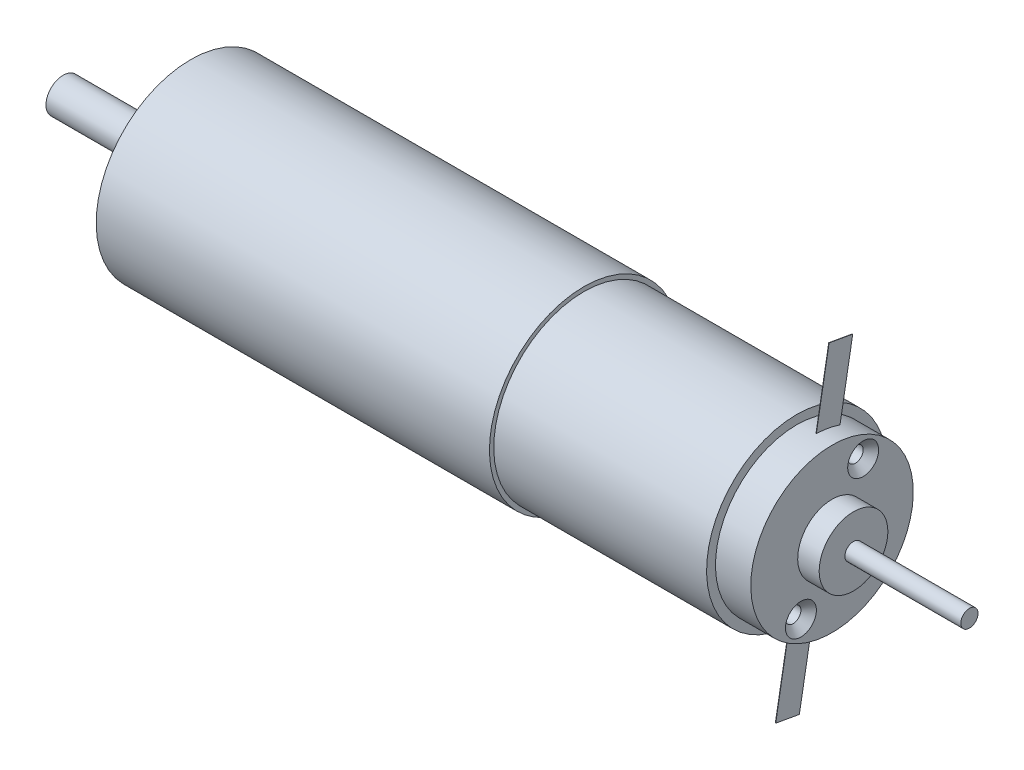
ISO-10303-21;
HEADER;
FILE_DESCRIPTION(('STEP AP214'),'2;1');
FILE_NAME('part.step','',(''),(''),'','','');
FILE_SCHEMA(('AUTOMOTIVE_DESIGN { 1 0 10303 214 1 1 1 1 }'));
ENDSEC;
DATA;
#1=APPLICATION_CONTEXT('core data for automotive mechanical design processes');
#2=APPLICATION_PROTOCOL_DEFINITION('international standard','automotive_design',2000,#1);
#3=PRODUCT_CONTEXT('',#1,'mechanical');
#4=PRODUCT('Part','Part','',(#3));
#5=PRODUCT_RELATED_PRODUCT_CATEGORY('part','',(#4));
#6=PRODUCT_DEFINITION_FORMATION('','',#4);
#7=PRODUCT_DEFINITION_CONTEXT('part definition',#1,'design');
#8=PRODUCT_DEFINITION('design','',#6,#7);
#9=PRODUCT_DEFINITION_SHAPE('','',#8);
#10=(LENGTH_UNIT() NAMED_UNIT(*) SI_UNIT(.MILLI.,.METRE.));
#11=(NAMED_UNIT(*) PLANE_ANGLE_UNIT() SI_UNIT($,.RADIAN.));
#12=(NAMED_UNIT(*) SI_UNIT($,.STERADIAN.) SOLID_ANGLE_UNIT());
#13=UNCERTAINTY_MEASURE_WITH_UNIT(LENGTH_MEASURE(1.E-05),#10,'distance_accuracy_value','');
#14=(GEOMETRIC_REPRESENTATION_CONTEXT(3) GLOBAL_UNCERTAINTY_ASSIGNED_CONTEXT((#13)) GLOBAL_UNIT_ASSIGNED_CONTEXT((#10,
#11,#12)) REPRESENTATION_CONTEXT('',''));
#15=CARTESIAN_POINT('',(0.,0.,0.));
#16=DIRECTION('',(0.,0.,1.));
#17=DIRECTION('',(1.,0.,0.));
#18=AXIS2_PLACEMENT_3D('',#15,#16,#17);
#19=CARTESIAN_POINT('',(44.9,0.,0.));
#20=DIRECTION('',(1.,0.,0.));
#21=DIRECTION('',(0.,1.,0.));
#22=AXIS2_PLACEMENT_3D('',#19,#20,#21);
#23=CYLINDRICAL_SURFACE('',#22,9.46149999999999);
#24=CARTESIAN_POINT('',(26.8252,0.,0.));
#25=DIRECTION('',(-1.,0.,0.));
#26=DIRECTION('',(0.,-1.,0.));
#27=AXIS2_PLACEMENT_3D('',#24,#25,#26);
#28=CIRCLE('',#27,9.46149999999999);
#29=CARTESIAN_POINT('',(26.8252,9.45829739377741,-0.246155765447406));
#30=VERTEX_POINT('',#29);
#31=CARTESIAN_POINT('',(26.8252,8.97208249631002,-3.00361747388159));
#32=VERTEX_POINT('',#31);
#33=EDGE_CURVE('E280',#30,#32,#28,.T.);
#34=ORIENTED_EDGE('',*,*,#33,.F.);
#35=DIRECTION('',(1.,0.,0.));
#36=VECTOR('',#35,1.);
#37=CARTESIAN_POINT('',(44.9,9.45829739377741,-0.246155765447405));
#38=LINE('',#37,#36);
#39=CARTESIAN_POINT('',(26.7852,9.45829739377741,-0.246155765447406));
#40=VERTEX_POINT('',#39);
#41=EDGE_CURVE('E278',#40,#30,#38,.T.);
#42=ORIENTED_EDGE('',*,*,#41,.F.);
#43=CARTESIAN_POINT('',(26.7852,0.,0.));
#44=DIRECTION('',(-1.,0.,0.));
#45=DIRECTION('',(0.,-1.,0.));
#46=AXIS2_PLACEMENT_3D('',#43,#44,#45);
#47=CIRCLE('',#46,9.46149999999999);
#48=CARTESIAN_POINT('',(26.7852,8.97208249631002,-3.00361747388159));
#49=VERTEX_POINT('',#48);
#50=EDGE_CURVE('E273',#40,#49,#47,.T.);
#51=ORIENTED_EDGE('',*,*,#50,.T.);
#52=DIRECTION('',(1.,0.,0.));
#53=VECTOR('',#52,1.);
#54=CARTESIAN_POINT('',(44.9,8.97208249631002,-3.00361747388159));
#55=LINE('',#54,#53);
#56=EDGE_CURVE('E276',#32,#49,#55,.F.);
#57=ORIENTED_EDGE('',*,*,#56,.F.);
#58=EDGE_LOOP('',(#34,#42,#51,#57));
#59=FACE_BOUND('',#58,.T.);
#60=CARTESIAN_POINT('',(28.9,0.,0.));
#61=DIRECTION('',(1.,0.,0.));
#62=DIRECTION('',(0.,1.,0.));
#63=AXIS2_PLACEMENT_3D('',#60,#61,#62);
#64=CIRCLE('',#63,9.46149999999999);
#65=CARTESIAN_POINT('',(28.9,9.46149999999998,0.));
#66=VERTEX_POINT('',#65);
#67=EDGE_CURVE('E228',#66,#66,#64,.T.);
#68=ORIENTED_EDGE('',*,*,#67,.F.);
#69=EDGE_LOOP('',(#68));
#70=FACE_BOUND('',#69,.T.);
#71=CARTESIAN_POINT('',(24.7852,0.,0.));
#72=DIRECTION('',(1.,0.,0.));
#73=DIRECTION('',(0.,1.,0.));
#74=AXIS2_PLACEMENT_3D('',#71,#72,#73);
#75=CIRCLE('',#74,9.46149999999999);
#76=CARTESIAN_POINT('',(24.7852,9.46149999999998,0.));
#77=VERTEX_POINT('',#76);
#78=EDGE_CURVE('E225',#77,#77,#75,.T.);
#79=ORIENTED_EDGE('',*,*,#78,.T.);
#80=EDGE_LOOP('',(#79));
#81=FACE_BOUND('',#80,.T.);
#82=CARTESIAN_POINT('',(26.8252,0.,0.));
#83=DIRECTION('',(-1.,0.,0.));
#84=DIRECTION('',(0.,-1.,0.));
#85=AXIS2_PLACEMENT_3D('',#82,#83,#84);
#86=CIRCLE('',#85,9.46149999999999);
#87=CARTESIAN_POINT('',(26.8252,-9.45829739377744,0.246155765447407));
#88=VERTEX_POINT('',#87);
#89=CARTESIAN_POINT('',(26.8252,-8.97208249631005,3.00361747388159));
#90=VERTEX_POINT('',#89);
#91=EDGE_CURVE('E11',#88,#90,#86,.T.);
#92=ORIENTED_EDGE('',*,*,#91,.F.);
#93=DIRECTION('',(1.,0.,0.));
#94=VECTOR('',#93,1.);
#95=CARTESIAN_POINT('',(44.9,-9.45829739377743,0.246155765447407));
#96=LINE('',#95,#94);
#97=CARTESIAN_POINT('',(26.7852,-9.45829739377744,0.246155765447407));
#98=VERTEX_POINT('',#97);
#99=EDGE_CURVE('E285',#98,#88,#96,.T.);
#100=ORIENTED_EDGE('',*,*,#99,.F.);
#101=CARTESIAN_POINT('',(26.7852,0.,0.));
#102=DIRECTION('',(-1.,0.,0.));
#103=DIRECTION('',(0.,-1.,0.));
#104=AXIS2_PLACEMENT_3D('',#101,#102,#103);
#105=CIRCLE('',#104,9.46149999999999);
#106=CARTESIAN_POINT('',(26.7852,-8.97208249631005,3.00361747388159));
#107=VERTEX_POINT('',#106);
#108=EDGE_CURVE('E282',#98,#107,#105,.T.);
#109=ORIENTED_EDGE('',*,*,#108,.T.);
#110=DIRECTION('',(1.,0.,0.));
#111=VECTOR('',#110,1.);
#112=CARTESIAN_POINT('',(44.9,-8.97208249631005,3.00361747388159));
#113=LINE('',#112,#111);
#114=EDGE_CURVE('E45',#90,#107,#113,.F.);
#115=ORIENTED_EDGE('',*,*,#114,.F.);
#116=EDGE_LOOP('',(#92,#100,#109,#115));
#117=FACE_BOUND('',#116,.T.);
#118=ADVANCED_FACE('F37',(#59,#70,#81,#117),#23,.T.);
#119=CARTESIAN_POINT('',(0.,-10.5,0.));
#120=DIRECTION('',(-1.,0.,0.));
#121=DIRECTION('',(0.,-1.,0.));
#122=AXIS2_PLACEMENT_3D('',#119,#120,#121);
#123=PLANE('',#122);
#124=CARTESIAN_POINT('',(0.,0.,0.));
#125=DIRECTION('',(1.,0.,0.));
#126=DIRECTION('',(0.,1.,0.));
#127=AXIS2_PLACEMENT_3D('',#124,#125,#126);
#128=CIRCLE('',#127,10.5);
#129=CARTESIAN_POINT('',(0.,10.5,0.));
#130=VERTEX_POINT('',#129);
#131=EDGE_CURVE('E219',#130,#130,#128,.T.);
#132=ORIENTED_EDGE('',*,*,#131,.F.);
#133=EDGE_LOOP('',(#132));
#134=FACE_BOUND('',#133,.T.);
#135=CARTESIAN_POINT('',(0.,0.,0.));
#136=DIRECTION('',(1.,0.,0.));
#137=DIRECTION('',(0.,1.,0.));
#138=AXIS2_PLACEMENT_3D('',#135,#136,#137);
#139=CIRCLE('',#138,11.);
#140=CARTESIAN_POINT('',(0.,11.,0.));
#141=VERTEX_POINT('',#140);
#142=EDGE_CURVE('E264',#141,#141,#139,.T.);
#143=ORIENTED_EDGE('',*,*,#142,.T.);
#144=EDGE_LOOP('',(#143));
#145=FACE_BOUND('',#144,.T.);
#146=ADVANCED_FACE('F39',(#134,#145),#123,.F.);
#147=CARTESIAN_POINT('',(44.9,0.,0.));
#148=DIRECTION('',(1.,0.,0.));
#149=DIRECTION('',(0.,1.,0.));
#150=AXIS2_PLACEMENT_3D('',#147,#148,#149);
#151=CYLINDRICAL_SURFACE('',#150,11.);
#152=ORIENTED_EDGE('',*,*,#142,.F.);
#153=EDGE_LOOP('',(#152));
#154=FACE_BOUND('',#153,.T.);
#155=CARTESIAN_POINT('',(-45.8,0.,0.));
#156=DIRECTION('',(1.,0.,0.));
#157=DIRECTION('',(0.,1.,0.));
#158=AXIS2_PLACEMENT_3D('',#155,#156,#157);
#159=CIRCLE('',#158,11.);
#160=CARTESIAN_POINT('',(-45.8,11.,0.));
#161=VERTEX_POINT('',#160);
#162=EDGE_CURVE('E261',#161,#161,#159,.T.);
#163=ORIENTED_EDGE('',*,*,#162,.T.);
#164=EDGE_LOOP('',(#163));
#165=FACE_BOUND('',#164,.T.);
#166=ADVANCED_FACE('F320',(#154,#165),#151,.T.);
#167=CARTESIAN_POINT('',(-45.8,-11.,0.));
#168=DIRECTION('',(1.,0.,0.));
#169=DIRECTION('',(0.,1.,0.));
#170=AXIS2_PLACEMENT_3D('',#167,#168,#169);
#171=PLANE('',#170);
#172=CARTESIAN_POINT('',(-45.8,7.,0.));
#173=DIRECTION('',(-1.,0.,0.));
#174=DIRECTION('',(0.,0.,1.));
#175=AXIS2_PLACEMENT_3D('',#172,#173,#174);
#176=CIRCLE('',#175,1.025);
#177=CARTESIAN_POINT('',(-45.8,7.,1.025));
#178=VERTEX_POINT('',#177);
#179=EDGE_CURVE('E152',#178,#178,#176,.T.);
#180=ORIENTED_EDGE('',*,*,#179,.F.);
#181=EDGE_LOOP('',(#180));
#182=FACE_BOUND('',#181,.T.);
#183=CARTESIAN_POINT('',(-45.8,-3.50000000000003,6.06217782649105));
#184=DIRECTION('',(-1.,0.,0.));
#185=DIRECTION('',(0.,0.,1.));
#186=AXIS2_PLACEMENT_3D('',#183,#184,#185);
#187=CIRCLE('',#186,1.025);
#188=CARTESIAN_POINT('',(-45.8,-3.50000000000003,7.08717782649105));
#189=VERTEX_POINT('',#188);
#190=EDGE_CURVE('E158',#189,#189,#187,.T.);
#191=ORIENTED_EDGE('',*,*,#190,.F.);
#192=EDGE_LOOP('',(#191));
#193=FACE_BOUND('',#192,.T.);
#194=CARTESIAN_POINT('',(-45.8,-3.50000000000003,-6.06217782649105));
#195=DIRECTION('',(-1.,0.,0.));
#196=DIRECTION('',(0.,0.,1.));
#197=AXIS2_PLACEMENT_3D('',#194,#195,#196);
#198=CIRCLE('',#197,1.025);
#199=CARTESIAN_POINT('',(-45.8,-3.50000000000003,-5.03717782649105));
#200=VERTEX_POINT('',#199);
#201=EDGE_CURVE('E164',#200,#200,#198,.T.);
#202=ORIENTED_EDGE('',*,*,#201,.F.);
#203=EDGE_LOOP('',(#202));
#204=FACE_BOUND('',#203,.T.);
#205=ORIENTED_EDGE('',*,*,#162,.F.);
#206=EDGE_LOOP('',(#205));
#207=FACE_BOUND('',#206,.T.);
#208=CARTESIAN_POINT('',(-45.8,0.,0.));
#209=DIRECTION('',(1.,0.,0.));
#210=DIRECTION('',(0.,1.,0.));
#211=AXIS2_PLACEMENT_3D('',#208,#209,#210);
#212=CIRCLE('',#211,5.);
#213=CARTESIAN_POINT('',(-45.8,4.99999999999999,0.));
#214=VERTEX_POINT('',#213);
#215=EDGE_CURVE('E258',#214,#214,#212,.T.);
#216=ORIENTED_EDGE('',*,*,#215,.T.);
#217=EDGE_LOOP('',(#216));
#218=FACE_BOUND('',#217,.T.);
#219=ADVANCED_FACE('F371',(#182,#193,#204,#207,#218),#171,.F.);
#220=CARTESIAN_POINT('',(44.9,0.,0.));
#221=DIRECTION('',(1.,0.,0.));
#222=DIRECTION('',(0.,1.,0.));
#223=AXIS2_PLACEMENT_3D('',#220,#221,#222);
#224=CYLINDRICAL_SURFACE('',#223,5.);
#225=ORIENTED_EDGE('',*,*,#215,.F.);
#226=EDGE_LOOP('',(#225));
#227=FACE_BOUND('',#226,.T.);
#228=CARTESIAN_POINT('',(-47.15,0.,0.));
#229=DIRECTION('',(1.,0.,0.));
#230=DIRECTION('',(0.,1.,0.));
#231=AXIS2_PLACEMENT_3D('',#228,#229,#230);
#232=CIRCLE('',#231,5.);
#233=CARTESIAN_POINT('',(-47.15,4.99999999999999,0.));
#234=VERTEX_POINT('',#233);
#235=EDGE_CURVE('E255',#234,#234,#232,.T.);
#236=ORIENTED_EDGE('',*,*,#235,.T.);
#237=EDGE_LOOP('',(#236));
#238=FACE_BOUND('',#237,.T.);
#239=ADVANCED_FACE('F367',(#227,#238),#224,.T.);
#240=CARTESIAN_POINT('',(-47.15,-5.00000000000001,0.));
#241=DIRECTION('',(1.,0.,0.));
#242=DIRECTION('',(0.,1.,0.));
#243=AXIS2_PLACEMENT_3D('',#240,#241,#242);
#244=PLANE('',#243);
#245=ORIENTED_EDGE('',*,*,#235,.F.);
#246=EDGE_LOOP('',(#245));
#247=FACE_BOUND('',#246,.T.);
#248=CARTESIAN_POINT('',(-47.15,0.,0.));
#249=DIRECTION('',(1.,0.,0.));
#250=DIRECTION('',(0.,1.,0.));
#251=AXIS2_PLACEMENT_3D('',#248,#249,#250);
#252=CIRCLE('',#251,3.4925);
#253=CARTESIAN_POINT('',(-47.15,3.49249999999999,0.));
#254=VERTEX_POINT('',#253);
#255=EDGE_CURVE('E252',#254,#254,#252,.T.);
#256=ORIENTED_EDGE('',*,*,#255,.T.);
#257=EDGE_LOOP('',(#256));
#258=FACE_BOUND('',#257,.T.);
#259=ADVANCED_FACE('F363',(#247,#258),#244,.F.);
#260=CARTESIAN_POINT('',(44.9,0.,0.));
#261=DIRECTION('',(1.,0.,0.));
#262=DIRECTION('',(0.,1.,0.));
#263=AXIS2_PLACEMENT_3D('',#260,#261,#262);
#264=CYLINDRICAL_SURFACE('',#263,3.4925);
#265=ORIENTED_EDGE('',*,*,#255,.F.);
#266=EDGE_LOOP('',(#265));
#267=FACE_BOUND('',#266,.T.);
#268=CARTESIAN_POINT('',(-48.95,0.,0.));
#269=DIRECTION('',(1.,0.,0.));
#270=DIRECTION('',(0.,1.,0.));
#271=AXIS2_PLACEMENT_3D('',#268,#269,#270);
#272=CIRCLE('',#271,3.4925);
#273=CARTESIAN_POINT('',(-48.95,3.49249999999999,0.));
#274=VERTEX_POINT('',#273);
#275=EDGE_CURVE('E249',#274,#274,#272,.T.);
#276=ORIENTED_EDGE('',*,*,#275,.T.);
#277=EDGE_LOOP('',(#276));
#278=FACE_BOUND('',#277,.T.);
#279=ADVANCED_FACE('F359',(#267,#278),#264,.T.);
#280=CARTESIAN_POINT('',(-48.95,-3.49250000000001,0.));
#281=DIRECTION('',(1.,0.,0.));
#282=DIRECTION('',(0.,1.,0.));
#283=AXIS2_PLACEMENT_3D('',#280,#281,#282);
#284=PLANE('',#283);
#285=ORIENTED_EDGE('',*,*,#275,.F.);
#286=EDGE_LOOP('',(#285));
#287=FACE_BOUND('',#286,.T.);
#288=CARTESIAN_POINT('',(-48.95,0.,0.));
#289=DIRECTION('',(1.,0.,0.));
#290=DIRECTION('',(0.,1.,0.));
#291=AXIS2_PLACEMENT_3D('',#288,#289,#290);
#292=CIRCLE('',#291,2.);
#293=CARTESIAN_POINT('',(-48.95,1.99999999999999,0.));
#294=VERTEX_POINT('',#293);
#295=EDGE_CURVE('E246',#294,#294,#292,.T.);
#296=ORIENTED_EDGE('',*,*,#295,.T.);
#297=EDGE_LOOP('',(#296));
#298=FACE_BOUND('',#297,.T.);
#299=ADVANCED_FACE('F355',(#287,#298),#284,.F.);
#300=CARTESIAN_POINT('',(44.9,0.,0.));
#301=DIRECTION('',(1.,0.,0.));
#302=DIRECTION('',(0.,1.,0.));
#303=AXIS2_PLACEMENT_3D('',#300,#301,#302);
#304=CYLINDRICAL_SURFACE('',#303,2.);
#305=ORIENTED_EDGE('',*,*,#295,.F.);
#306=EDGE_LOOP('',(#305));
#307=FACE_BOUND('',#306,.T.);
#308=CARTESIAN_POINT('',(-60.65,0.,0.));
#309=DIRECTION('',(1.,0.,0.));
#310=DIRECTION('',(0.,1.,0.));
#311=AXIS2_PLACEMENT_3D('',#308,#309,#310);
#312=CIRCLE('',#311,2.);
#313=CARTESIAN_POINT('',(-60.65,1.32287565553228,-1.5));
#314=VERTEX_POINT('',#313);
#315=CARTESIAN_POINT('',(-60.65,-1.32287565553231,-1.5));
#316=VERTEX_POINT('',#315);
#317=EDGE_CURVE('E243',#314,#316,#312,.T.);
#318=ORIENTED_EDGE('',*,*,#317,.T.);
#319=DIRECTION('',(1.,0.,0.));
#320=VECTOR('',#319,1.);
#321=CARTESIAN_POINT('',(44.9,-1.32287565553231,-1.5));
#322=LINE('',#321,#320);
#323=CARTESIAN_POINT('',(-51.35,-1.32287565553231,-1.5));
#324=VERTEX_POINT('',#323);
#325=EDGE_CURVE('E216',#316,#324,#322,.T.);
#326=ORIENTED_EDGE('',*,*,#325,.T.);
#327=CARTESIAN_POINT('',(-51.35,0.,0.));
#328=DIRECTION('',(1.,0.,0.));
#329=DIRECTION('',(0.,0.,-1.));
#330=AXIS2_PLACEMENT_3D('',#327,#328,#329);
#331=CIRCLE('',#330,2.);
#332=CARTESIAN_POINT('',(-51.35,1.32287565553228,-1.5));
#333=VERTEX_POINT('',#332);
#334=EDGE_CURVE('E270',#324,#333,#331,.T.);
#335=ORIENTED_EDGE('',*,*,#334,.T.);
#336=DIRECTION('',(1.,0.,0.));
#337=VECTOR('',#336,1.);
#338=CARTESIAN_POINT('',(44.9,1.32287565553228,-1.5));
#339=LINE('',#338,#337);
#340=EDGE_CURVE('E213',#333,#314,#339,.F.);
#341=ORIENTED_EDGE('',*,*,#340,.T.);
#342=EDGE_LOOP('',(#318,#326,#335,#341));
#343=FACE_BOUND('',#342,.T.);
#344=ADVANCED_FACE('F351',(#307,#343),#304,.T.);
#345=CARTESIAN_POINT('',(-60.65,-2.00000000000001,0.));
#346=DIRECTION('',(1.,0.,0.));
#347=DIRECTION('',(0.,1.,0.));
#348=AXIS2_PLACEMENT_3D('',#345,#346,#347);
#349=PLANE('',#348);
#350=ORIENTED_EDGE('',*,*,#317,.F.);
#351=DIRECTION('',(0.,-1.,0.));
#352=VECTOR('',#351,1.);
#353=CARTESIAN_POINT('',(-60.65,-2.00000000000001,-1.5));
#354=LINE('',#353,#352);
#355=EDGE_CURVE('E267',#314,#316,#354,.T.);
#356=ORIENTED_EDGE('',*,*,#355,.T.);
#357=EDGE_LOOP('',(#350,#356));
#358=FACE_BOUND('',#357,.T.);
#359=ADVANCED_FACE('F347',(#358),#349,.F.);
#360=CARTESIAN_POINT('',(44.9,-1.,0.));
#361=DIRECTION('',(-1.,0.,0.));
#362=DIRECTION('',(0.,-1.,0.));
#363=AXIS2_PLACEMENT_3D('',#360,#361,#362);
#364=PLANE('',#363);
#365=CARTESIAN_POINT('',(44.9,0.,0.));
#366=DIRECTION('',(1.,0.,0.));
#367=DIRECTION('',(0.,1.,0.));
#368=AXIS2_PLACEMENT_3D('',#365,#366,#367);
#369=CIRCLE('',#368,0.999999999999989);
#370=CARTESIAN_POINT('',(44.9,0.999999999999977,0.));
#371=VERTEX_POINT('',#370);
#372=EDGE_CURVE('E240',#371,#371,#369,.T.);
#373=ORIENTED_EDGE('',*,*,#372,.T.);
#374=EDGE_LOOP('',(#373));
#375=FACE_BOUND('',#374,.T.);
#376=ADVANCED_FACE('F343',(#375),#364,.F.);
#377=CARTESIAN_POINT('',(44.9,0.,0.));
#378=DIRECTION('',(1.,0.,0.));
#379=DIRECTION('',(0.,1.,0.));
#380=AXIS2_PLACEMENT_3D('',#377,#378,#379);
#381=CYLINDRICAL_SURFACE('',#380,0.99999999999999);
#382=ORIENTED_EDGE('',*,*,#372,.F.);
#383=EDGE_LOOP('',(#382));
#384=FACE_BOUND('',#383,.T.);
#385=CARTESIAN_POINT('',(31.4,0.,0.));
#386=DIRECTION('',(1.,0.,0.));
#387=DIRECTION('',(0.,1.,0.));
#388=AXIS2_PLACEMENT_3D('',#385,#386,#387);
#389=CIRCLE('',#388,0.99999999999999);
#390=CARTESIAN_POINT('',(31.4,0.999999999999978,0.));
#391=VERTEX_POINT('',#390);
#392=EDGE_CURVE('E237',#391,#391,#389,.T.);
#393=ORIENTED_EDGE('',*,*,#392,.T.);
#394=EDGE_LOOP('',(#393));
#395=FACE_BOUND('',#394,.T.);
#396=ADVANCED_FACE('F339',(#384,#395),#381,.T.);
#397=CARTESIAN_POINT('',(31.4,-4.,0.));
#398=DIRECTION('',(-1.,0.,0.));
#399=DIRECTION('',(0.,-1.,0.));
#400=AXIS2_PLACEMENT_3D('',#397,#398,#399);
#401=PLANE('',#400);
#402=ORIENTED_EDGE('',*,*,#392,.F.);
#403=EDGE_LOOP('',(#402));
#404=FACE_BOUND('',#403,.T.);
#405=CARTESIAN_POINT('',(31.4,0.,0.));
#406=DIRECTION('',(1.,0.,0.));
#407=DIRECTION('',(0.,1.,0.));
#408=AXIS2_PLACEMENT_3D('',#405,#406,#407);
#409=CIRCLE('',#408,3.99999999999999);
#410=CARTESIAN_POINT('',(31.4,3.99999999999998,0.));
#411=VERTEX_POINT('',#410);
#412=EDGE_CURVE('E234',#411,#411,#409,.T.);
#413=ORIENTED_EDGE('',*,*,#412,.T.);
#414=EDGE_LOOP('',(#413));
#415=FACE_BOUND('',#414,.T.);
#416=ADVANCED_FACE('F335',(#404,#415),#401,.F.);
#417=CARTESIAN_POINT('',(44.9,0.,0.));
#418=DIRECTION('',(1.,0.,0.));
#419=DIRECTION('',(0.,1.,0.));
#420=AXIS2_PLACEMENT_3D('',#417,#418,#419);
#421=CYLINDRICAL_SURFACE('',#420,3.99999999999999);
#422=ORIENTED_EDGE('',*,*,#412,.F.);
#423=EDGE_LOOP('',(#422));
#424=FACE_BOUND('',#423,.T.);
#425=CARTESIAN_POINT('',(28.9,0.,0.));
#426=DIRECTION('',(1.,0.,0.));
#427=DIRECTION('',(0.,1.,0.));
#428=AXIS2_PLACEMENT_3D('',#425,#426,#427);
#429=CIRCLE('',#428,3.99999999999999);
#430=CARTESIAN_POINT('',(28.9,3.99999999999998,0.));
#431=VERTEX_POINT('',#430);
#432=EDGE_CURVE('E231',#431,#431,#429,.T.);
#433=ORIENTED_EDGE('',*,*,#432,.T.);
#434=EDGE_LOOP('',(#433));
#435=FACE_BOUND('',#434,.T.);
#436=ADVANCED_FACE('F331',(#424,#435),#421,.T.);
#437=CARTESIAN_POINT('',(28.9,-9.4615,0.));
#438=DIRECTION('',(-1.,0.,0.));
#439=DIRECTION('',(0.,-1.,0.));
#440=AXIS2_PLACEMENT_3D('',#437,#438,#439);
#441=PLANE('',#440);
#442=CARTESIAN_POINT('',(28.9,6.27868417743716,-3.62500000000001));
#443=DIRECTION('',(1.,0.,0.));
#444=DIRECTION('',(0.,0.,-1.));
#445=AXIS2_PLACEMENT_3D('',#442,#443,#444);
#446=CIRCLE('',#445,1.8);
#447=CARTESIAN_POINT('',(28.9,6.27868417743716,-5.42500000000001));
#448=VERTEX_POINT('',#447);
#449=EDGE_CURVE('E143',#448,#448,#446,.T.);
#450=ORIENTED_EDGE('',*,*,#449,.F.);
#451=EDGE_LOOP('',(#450));
#452=FACE_BOUND('',#451,.T.);
#453=CARTESIAN_POINT('',(28.9,-6.27868417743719,3.62500000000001));
#454=DIRECTION('',(1.,0.,0.));
#455=DIRECTION('',(0.,0.,-1.));
#456=AXIS2_PLACEMENT_3D('',#453,#454,#455);
#457=CIRCLE('',#456,1.8);
#458=CARTESIAN_POINT('',(28.9,-6.27868417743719,1.82500000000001));
#459=VERTEX_POINT('',#458);
#460=EDGE_CURVE('E136',#459,#459,#457,.T.);
#461=ORIENTED_EDGE('',*,*,#460,.F.);
#462=EDGE_LOOP('',(#461));
#463=FACE_BOUND('',#462,.T.);
#464=ORIENTED_EDGE('',*,*,#432,.F.);
#465=EDGE_LOOP('',(#464));
#466=FACE_BOUND('',#465,.T.);
#467=ORIENTED_EDGE('',*,*,#67,.T.);
#468=EDGE_LOOP('',(#467));
#469=FACE_BOUND('',#468,.T.);
#470=ADVANCED_FACE('F328',(#452,#463,#466,#469),#441,.F.);
#471=CARTESIAN_POINT('',(24.7852,-10.5,0.));
#472=DIRECTION('',(-1.,0.,0.));
#473=DIRECTION('',(0.,-1.,0.));
#474=AXIS2_PLACEMENT_3D('',#471,#472,#473);
#475=PLANE('',#474);
#476=ORIENTED_EDGE('',*,*,#78,.F.);
#477=EDGE_LOOP('',(#476));
#478=FACE_BOUND('',#477,.T.);
#479=CARTESIAN_POINT('',(24.7852,0.,0.));
#480=DIRECTION('',(1.,0.,0.));
#481=DIRECTION('',(0.,1.,0.));
#482=AXIS2_PLACEMENT_3D('',#479,#480,#481);
#483=CIRCLE('',#482,10.5);
#484=CARTESIAN_POINT('',(24.7852,10.5,0.));
#485=VERTEX_POINT('',#484);
#486=EDGE_CURVE('E222',#485,#485,#483,.T.);
#487=ORIENTED_EDGE('',*,*,#486,.T.);
#488=EDGE_LOOP('',(#487));
#489=FACE_BOUND('',#488,.T.);
#490=ADVANCED_FACE('F326',(#478,#489),#475,.F.);
#491=CARTESIAN_POINT('',(44.9,0.,0.));
#492=DIRECTION('',(1.,0.,0.));
#493=DIRECTION('',(0.,1.,0.));
#494=AXIS2_PLACEMENT_3D('',#491,#492,#493);
#495=CYLINDRICAL_SURFACE('',#494,10.5);
#496=ORIENTED_EDGE('',*,*,#486,.F.);
#497=EDGE_LOOP('',(#496));
#498=FACE_BOUND('',#497,.T.);
#499=ORIENTED_EDGE('',*,*,#131,.T.);
#500=EDGE_LOOP('',(#499));
#501=FACE_BOUND('',#500,.T.);
#502=ADVANCED_FACE('F401',(#498,#501),#495,.T.);
#503=CARTESIAN_POINT('',(-51.35,-11.,-5.18121484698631));
#504=DIRECTION('',(1.,0.,0.));
#505=DIRECTION('',(0.,0.,-1.));
#506=AXIS2_PLACEMENT_3D('',#503,#504,#505);
#507=PLANE('',#506);
#508=DIRECTION('',(0.,1.,0.));
#509=VECTOR('',#508,1.);
#510=CARTESIAN_POINT('',(-51.35,-11.,-1.5));
#511=LINE('',#510,#509);
#512=EDGE_CURVE('E210',#324,#333,#511,.T.);
#513=ORIENTED_EDGE('',*,*,#512,.T.);
#514=ORIENTED_EDGE('',*,*,#334,.F.);
#515=EDGE_LOOP('',(#513,#514));
#516=FACE_BOUND('',#515,.T.);
#517=ADVANCED_FACE('F399',(#516),#507,.F.);
#518=CARTESIAN_POINT('',(-63.9871380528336,-11.,-1.5));
#519=DIRECTION('',(0.,0.,1.));
#520=DIRECTION('',(1.,0.,0.));
#521=AXIS2_PLACEMENT_3D('',#518,#519,#520);
#522=PLANE('',#521);
#523=ORIENTED_EDGE('',*,*,#355,.F.);
#524=ORIENTED_EDGE('',*,*,#340,.F.);
#525=ORIENTED_EDGE('',*,*,#512,.F.);
#526=ORIENTED_EDGE('',*,*,#325,.F.);
#527=EDGE_LOOP('',(#523,#524,#525,#526));
#528=FACE_BOUND('',#527,.T.);
#529=ADVANCED_FACE('F396',(#528),#522,.F.);
#530=CARTESIAN_POINT('',(26.8252,17.8711662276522,-1.72957152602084));
#531=DIRECTION('',(0.,-0.173648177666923,-0.984807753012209));
#532=DIRECTION('',(0.,0.984807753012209,-0.173648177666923));
#533=AXIS2_PLACEMENT_3D('',#530,#531,#532);
#534=PLANE('',#533);
#535=DIRECTION('',(0.,-0.984807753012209,0.173648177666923));
#536=VECTOR('',#535,1.);
#537=CARTESIAN_POINT('',(26.7852,17.8711662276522,-1.72957152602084));
#538=LINE('',#537,#536);
#539=CARTESIAN_POINT('',(26.7852,17.8711662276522,-1.72957152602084));
#540=VERTEX_POINT('',#539);
#541=EDGE_CURVE('E201',#540,#40,#538,.T.);
#542=ORIENTED_EDGE('',*,*,#541,.T.);
#543=ORIENTED_EDGE('',*,*,#41,.T.);
#544=DIRECTION('',(0.,-0.984807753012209,0.173648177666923));
#545=VECTOR('',#544,1.);
#546=CARTESIAN_POINT('',(26.8252,17.8711662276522,-1.72957152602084));
#547=LINE('',#546,#545);
#548=CARTESIAN_POINT('',(26.8252,17.8711662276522,-1.72957152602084));
#549=VERTEX_POINT('',#548);
#550=EDGE_CURVE('E193',#549,#30,#547,.T.);
#551=ORIENTED_EDGE('',*,*,#550,.F.);
#552=DIRECTION('',(-1.,0.,0.));
#553=VECTOR('',#552,1.);
#554=CARTESIAN_POINT('',(26.8252,17.8711662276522,-1.72957152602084));
#555=LINE('',#554,#553);
#556=EDGE_CURVE('E207',#549,#540,#555,.T.);
#557=ORIENTED_EDGE('',*,*,#556,.T.);
#558=EDGE_LOOP('',(#542,#543,#551,#557));
#559=FACE_BOUND('',#558,.T.);
#560=ADVANCED_FACE('F407',(#559),#534,.F.);
#561=CARTESIAN_POINT('',(26.8252,17.3849513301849,-4.48703323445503));
#562=DIRECTION('',(0.,0.173648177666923,0.984807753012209));
#563=DIRECTION('',(0.,-0.984807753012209,0.173648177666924));
#564=AXIS2_PLACEMENT_3D('',#561,#562,#563);
#565=PLANE('',#564);
#566=DIRECTION('',(0.,0.984807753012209,-0.173648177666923));
#567=VECTOR('',#566,1.);
#568=CARTESIAN_POINT('',(26.8252,17.3849513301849,-4.48703323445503));
#569=LINE('',#568,#567);
#570=CARTESIAN_POINT('',(26.8252,17.3849513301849,-4.48703323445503));
#571=VERTEX_POINT('',#570);
#572=EDGE_CURVE('E196',#32,#571,#569,.T.);
#573=ORIENTED_EDGE('',*,*,#572,.F.);
#574=ORIENTED_EDGE('',*,*,#56,.T.);
#575=DIRECTION('',(0.,0.984807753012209,-0.173648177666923));
#576=VECTOR('',#575,1.);
#577=CARTESIAN_POINT('',(26.7852,17.3849513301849,-4.48703323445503));
#578=LINE('',#577,#576);
#579=CARTESIAN_POINT('',(26.7852,17.3849513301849,-4.48703323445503));
#580=VERTEX_POINT('',#579);
#581=EDGE_CURVE('E60',#49,#580,#578,.T.);
#582=ORIENTED_EDGE('',*,*,#581,.T.);
#583=DIRECTION('',(-1.,0.,0.));
#584=VECTOR('',#583,1.);
#585=CARTESIAN_POINT('',(26.8252,17.3849513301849,-4.48703323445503));
#586=LINE('',#585,#584);
#587=EDGE_CURVE('E198',#571,#580,#586,.T.);
#588=ORIENTED_EDGE('',*,*,#587,.F.);
#589=EDGE_LOOP('',(#573,#574,#582,#588));
#590=FACE_BOUND('',#589,.T.);
#591=ADVANCED_FACE('F418',(#590),#565,.F.);
#592=CARTESIAN_POINT('',(26.8252,17.3849513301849,-4.48703323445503));
#593=DIRECTION('',(-1.,0.,0.));
#594=DIRECTION('',(0.,-1.,0.));
#595=AXIS2_PLACEMENT_3D('',#592,#593,#594);
#596=PLANE('',#595);
#597=ORIENTED_EDGE('',*,*,#550,.T.);
#598=ORIENTED_EDGE('',*,*,#33,.T.);
#599=ORIENTED_EDGE('',*,*,#572,.T.);
#600=DIRECTION('',(0.,0.173648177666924,0.984807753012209));
#601=VECTOR('',#600,1.);
#602=CARTESIAN_POINT('',(26.8252,17.8711662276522,-1.72957152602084));
#603=LINE('',#602,#601);
#604=EDGE_CURVE('E190',#571,#549,#603,.T.);
#605=ORIENTED_EDGE('',*,*,#604,.T.);
#606=EDGE_LOOP('',(#597,#598,#599,#605));
#607=FACE_BOUND('',#606,.T.);
#608=ADVANCED_FACE('F422',(#607),#596,.F.);
#609=CARTESIAN_POINT('',(26.7852,17.3849513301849,-4.48703323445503));
#610=DIRECTION('',(-1.,0.,0.));
#611=DIRECTION('',(0.,-1.,0.));
#612=AXIS2_PLACEMENT_3D('',#609,#610,#611);
#613=PLANE('',#612);
#614=ORIENTED_EDGE('',*,*,#50,.F.);
#615=ORIENTED_EDGE('',*,*,#541,.F.);
#616=DIRECTION('',(0.,0.173648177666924,0.984807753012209));
#617=VECTOR('',#616,1.);
#618=CARTESIAN_POINT('',(26.7852,17.8711662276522,-1.72957152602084));
#619=LINE('',#618,#617);
#620=EDGE_CURVE('E189',#580,#540,#619,.T.);
#621=ORIENTED_EDGE('',*,*,#620,.F.);
#622=ORIENTED_EDGE('',*,*,#581,.F.);
#623=EDGE_LOOP('',(#614,#615,#621,#622));
#624=FACE_BOUND('',#623,.T.);
#625=ADVANCED_FACE('F414',(#624),#613,.T.);
#626=CARTESIAN_POINT('',(26.8252,17.8711662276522,-1.72957152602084));
#627=DIRECTION('',(0.,-0.984807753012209,0.173648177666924));
#628=DIRECTION('',(0.,-0.173648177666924,-0.984807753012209));
#629=AXIS2_PLACEMENT_3D('',#626,#627,#628);
#630=PLANE('',#629);
#631=ORIENTED_EDGE('',*,*,#620,.T.);
#632=ORIENTED_EDGE('',*,*,#556,.F.);
#633=ORIENTED_EDGE('',*,*,#604,.F.);
#634=ORIENTED_EDGE('',*,*,#587,.T.);
#635=EDGE_LOOP('',(#631,#632,#633,#634));
#636=FACE_BOUND('',#635,.T.);
#637=ADVANCED_FACE('F411',(#636),#630,.F.);
#638=CARTESIAN_POINT('',(26.8252,-17.3849513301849,4.48703323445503));
#639=DIRECTION('',(0.,-0.173648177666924,-0.984807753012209));
#640=DIRECTION('',(0.,0.984807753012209,-0.173648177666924));
#641=AXIS2_PLACEMENT_3D('',#638,#639,#640);
#642=PLANE('',#641);
#643=DIRECTION('',(0.,-0.984807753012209,0.173648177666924));
#644=VECTOR('',#643,1.);
#645=CARTESIAN_POINT('',(26.8252,-17.3849513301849,4.48703323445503));
#646=LINE('',#645,#644);
#647=CARTESIAN_POINT('',(26.8252,-17.3849513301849,4.48703323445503));
#648=VERTEX_POINT('',#647);
#649=EDGE_CURVE('E170',#90,#648,#646,.T.);
#650=ORIENTED_EDGE('',*,*,#649,.F.);
#651=ORIENTED_EDGE('',*,*,#114,.T.);
#652=DIRECTION('',(0.,-0.984807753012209,0.173648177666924));
#653=VECTOR('',#652,1.);
#654=CARTESIAN_POINT('',(26.7852,-17.3849513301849,4.48703323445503));
#655=LINE('',#654,#653);
#656=CARTESIAN_POINT('',(26.7852,-17.3849513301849,4.48703323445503));
#657=VERTEX_POINT('',#656);
#658=EDGE_CURVE('E52',#107,#657,#655,.T.);
#659=ORIENTED_EDGE('',*,*,#658,.T.);
#660=DIRECTION('',(-1.,0.,0.));
#661=VECTOR('',#660,1.);
#662=CARTESIAN_POINT('',(26.8252,-17.3849513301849,4.48703323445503));
#663=LINE('',#662,#661);
#664=EDGE_CURVE('E186',#648,#657,#663,.T.);
#665=ORIENTED_EDGE('',*,*,#664,.F.);
#666=EDGE_LOOP('',(#650,#651,#659,#665));
#667=FACE_BOUND('',#666,.T.);
#668=ADVANCED_FACE('F289',(#667),#642,.F.);
#669=CARTESIAN_POINT('',(26.8252,-17.8711662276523,1.72957152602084));
#670=DIRECTION('',(0.,0.173648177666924,0.984807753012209));
#671=DIRECTION('',(0.,-0.984807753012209,0.173648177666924));
#672=AXIS2_PLACEMENT_3D('',#669,#670,#671);
#673=PLANE('',#672);
#674=DIRECTION('',(0.,0.984807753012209,-0.173648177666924));
#675=VECTOR('',#674,1.);
#676=CARTESIAN_POINT('',(26.7852,-17.8711662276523,1.72957152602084));
#677=LINE('',#676,#675);
#678=CARTESIAN_POINT('',(26.7852,-17.8711662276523,1.72957152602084));
#679=VERTEX_POINT('',#678);
#680=EDGE_CURVE('E173',#679,#98,#677,.T.);
#681=ORIENTED_EDGE('',*,*,#680,.T.);
#682=ORIENTED_EDGE('',*,*,#99,.T.);
#683=DIRECTION('',(0.,0.984807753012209,-0.173648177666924));
#684=VECTOR('',#683,1.);
#685=CARTESIAN_POINT('',(26.8252,-17.8711662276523,1.72957152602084));
#686=LINE('',#685,#684);
#687=CARTESIAN_POINT('',(26.8252,-17.8711662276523,1.72957152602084));
#688=VERTEX_POINT('',#687);
#689=EDGE_CURVE('E175',#688,#88,#686,.T.);
#690=ORIENTED_EDGE('',*,*,#689,.F.);
#691=DIRECTION('',(-1.,0.,0.));
#692=VECTOR('',#691,1.);
#693=CARTESIAN_POINT('',(26.8252,-17.8711662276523,1.72957152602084));
#694=LINE('',#693,#692);
#695=EDGE_CURVE('E178',#688,#679,#694,.T.);
#696=ORIENTED_EDGE('',*,*,#695,.T.);
#697=EDGE_LOOP('',(#681,#682,#690,#696));
#698=FACE_BOUND('',#697,.T.);
#699=ADVANCED_FACE('F297',(#698),#673,.F.);
#700=CARTESIAN_POINT('',(26.8252,-5.01029747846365,2.30504788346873));
#701=DIRECTION('',(-1.,0.,0.));
#702=DIRECTION('',(0.,-1.,0.));
#703=AXIS2_PLACEMENT_3D('',#700,#701,#702);
#704=PLANE('',#703);
#705=ORIENTED_EDGE('',*,*,#689,.T.);
#706=ORIENTED_EDGE('',*,*,#91,.T.);
#707=ORIENTED_EDGE('',*,*,#649,.T.);
#708=DIRECTION('',(0.,-0.173648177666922,-0.98480775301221));
#709=VECTOR('',#708,1.);
#710=CARTESIAN_POINT('',(26.8252,-17.3849513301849,4.48703323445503));
#711=LINE('',#710,#709);
#712=EDGE_CURVE('E172',#648,#688,#711,.T.);
#713=ORIENTED_EDGE('',*,*,#712,.T.);
#714=EDGE_LOOP('',(#705,#706,#707,#713));
#715=FACE_BOUND('',#714,.T.);
#716=ADVANCED_FACE('F304',(#715),#704,.F.);
#717=CARTESIAN_POINT('',(26.7852,-5.01029747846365,2.30504788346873));
#718=DIRECTION('',(-1.,0.,0.));
#719=DIRECTION('',(0.,-1.,0.));
#720=AXIS2_PLACEMENT_3D('',#717,#718,#719);
#721=PLANE('',#720);
#722=ORIENTED_EDGE('',*,*,#108,.F.);
#723=ORIENTED_EDGE('',*,*,#680,.F.);
#724=DIRECTION('',(0.,-0.173648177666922,-0.98480775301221));
#725=VECTOR('',#724,1.);
#726=CARTESIAN_POINT('',(26.7852,-17.3849513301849,4.48703323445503));
#727=LINE('',#726,#725);
#728=EDGE_CURVE('E180',#657,#679,#727,.T.);
#729=ORIENTED_EDGE('',*,*,#728,.F.);
#730=ORIENTED_EDGE('',*,*,#658,.F.);
#731=EDGE_LOOP('',(#722,#723,#729,#730));
#732=FACE_BOUND('',#731,.T.);
#733=ADVANCED_FACE('F295',(#732),#721,.T.);
#734=CARTESIAN_POINT('',(26.8252,-17.3849513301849,4.48703323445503));
#735=DIRECTION('',(0.,0.98480775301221,-0.173648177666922));
#736=DIRECTION('',(0.,0.173648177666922,0.98480775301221));
#737=AXIS2_PLACEMENT_3D('',#734,#735,#736);
#738=PLANE('',#737);
#739=ORIENTED_EDGE('',*,*,#728,.T.);
#740=ORIENTED_EDGE('',*,*,#695,.F.);
#741=ORIENTED_EDGE('',*,*,#712,.F.);
#742=ORIENTED_EDGE('',*,*,#664,.T.);
#743=EDGE_LOOP('',(#739,#740,#741,#742));
#744=FACE_BOUND('',#743,.T.);
#745=ADVANCED_FACE('F302',(#744),#738,.F.);
#746=CARTESIAN_POINT('',(-40.45,-3.50000000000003,-6.06217782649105));
#747=DIRECTION('',(-1.,0.,0.));
#748=DIRECTION('',(0.,0.,1.));
#749=AXIS2_PLACEMENT_3D('',#746,#747,#748);
#750=CONICAL_SURFACE('',#749,1.025,1.02974425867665);
#751=CARTESIAN_POINT('',(-39.8341178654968,-3.50000000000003,-6.06217782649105));
#752=VERTEX_POINT('',#751);
#753=VERTEX_LOOP('',#752);
#754=FACE_BOUND('',#753,.T.);
#755=CARTESIAN_POINT('',(-40.45,-3.50000000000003,-6.06217782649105));
#756=DIRECTION('',(-1.,0.,0.));
#757=DIRECTION('',(0.,0.,1.));
#758=AXIS2_PLACEMENT_3D('',#755,#756,#757);
#759=CIRCLE('',#758,1.025);
#760=CARTESIAN_POINT('',(-40.45,-3.50000000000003,-5.03717782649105));
#761=VERTEX_POINT('',#760);
#762=EDGE_CURVE('E167',#761,#761,#759,.T.);
#763=ORIENTED_EDGE('',*,*,#762,.T.);
#764=EDGE_LOOP('',(#763));
#765=FACE_BOUND('',#764,.T.);
#766=ADVANCED_FACE('F432',(#754,#765),#750,.F.);
#767=CARTESIAN_POINT('',(-45.8,-3.50000000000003,-6.06217782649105));
#768=DIRECTION('',(-1.,0.,0.));
#769=DIRECTION('',(0.,0.,1.));
#770=AXIS2_PLACEMENT_3D('',#767,#768,#769);
#771=CYLINDRICAL_SURFACE('',#770,1.025);
#772=ORIENTED_EDGE('',*,*,#762,.F.);
#773=EDGE_LOOP('',(#772));
#774=FACE_BOUND('',#773,.T.);
#775=ORIENTED_EDGE('',*,*,#201,.T.);
#776=EDGE_LOOP('',(#775));
#777=FACE_BOUND('',#776,.T.);
#778=ADVANCED_FACE('F436',(#774,#777),#771,.F.);
#779=CARTESIAN_POINT('',(-40.45,-3.50000000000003,6.06217782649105));
#780=DIRECTION('',(-1.,0.,0.));
#781=DIRECTION('',(0.,0.,1.));
#782=AXIS2_PLACEMENT_3D('',#779,#780,#781);
#783=CONICAL_SURFACE('',#782,1.025,1.02974425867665);
#784=CARTESIAN_POINT('',(-39.8341178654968,-3.50000000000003,6.06217782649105));
#785=VERTEX_POINT('',#784);
#786=VERTEX_LOOP('',#785);
#787=FACE_BOUND('',#786,.T.);
#788=CARTESIAN_POINT('',(-40.45,-3.50000000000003,6.06217782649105));
#789=DIRECTION('',(-1.,0.,0.));
#790=DIRECTION('',(0.,0.,1.));
#791=AXIS2_PLACEMENT_3D('',#788,#789,#790);
#792=CIRCLE('',#791,1.025);
#793=CARTESIAN_POINT('',(-40.45,-3.50000000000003,7.08717782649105));
#794=VERTEX_POINT('',#793);
#795=EDGE_CURVE('E161',#794,#794,#792,.T.);
#796=ORIENTED_EDGE('',*,*,#795,.T.);
#797=EDGE_LOOP('',(#796));
#798=FACE_BOUND('',#797,.T.);
#799=ADVANCED_FACE('F441',(#787,#798),#783,.F.);
#800=CARTESIAN_POINT('',(-45.8,-3.50000000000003,6.06217782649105));
#801=DIRECTION('',(-1.,0.,0.));
#802=DIRECTION('',(0.,0.,1.));
#803=AXIS2_PLACEMENT_3D('',#800,#801,#802);
#804=CYLINDRICAL_SURFACE('',#803,1.025);
#805=ORIENTED_EDGE('',*,*,#795,.F.);
#806=EDGE_LOOP('',(#805));
#807=FACE_BOUND('',#806,.T.);
#808=ORIENTED_EDGE('',*,*,#190,.T.);
#809=EDGE_LOOP('',(#808));
#810=FACE_BOUND('',#809,.T.);
#811=ADVANCED_FACE('F448',(#807,#810),#804,.F.);
#812=CARTESIAN_POINT('',(-40.45,7.,0.));
#813=DIRECTION('',(-1.,0.,0.));
#814=DIRECTION('',(0.,0.,1.));
#815=AXIS2_PLACEMENT_3D('',#812,#813,#814);
#816=CONICAL_SURFACE('',#815,1.025,1.02974425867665);
#817=CARTESIAN_POINT('',(-39.8341178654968,7.,0.));
#818=VERTEX_POINT('',#817);
#819=VERTEX_LOOP('',#818);
#820=FACE_BOUND('',#819,.T.);
#821=CARTESIAN_POINT('',(-40.45,7.,0.));
#822=DIRECTION('',(-1.,0.,0.));
#823=DIRECTION('',(0.,0.,1.));
#824=AXIS2_PLACEMENT_3D('',#821,#822,#823);
#825=CIRCLE('',#824,1.025);
#826=CARTESIAN_POINT('',(-40.45,7.,1.025));
#827=VERTEX_POINT('',#826);
#828=EDGE_CURVE('E155',#827,#827,#825,.T.);
#829=ORIENTED_EDGE('',*,*,#828,.T.);
#830=EDGE_LOOP('',(#829));
#831=FACE_BOUND('',#830,.T.);
#832=ADVANCED_FACE('F452',(#820,#831),#816,.F.);
#833=CARTESIAN_POINT('',(-45.8,7.,0.));
#834=DIRECTION('',(-1.,0.,0.));
#835=DIRECTION('',(0.,0.,1.));
#836=AXIS2_PLACEMENT_3D('',#833,#834,#835);
#837=CYLINDRICAL_SURFACE('',#836,1.025);
#838=ORIENTED_EDGE('',*,*,#828,.F.);
#839=EDGE_LOOP('',(#838));
#840=FACE_BOUND('',#839,.T.);
#841=ORIENTED_EDGE('',*,*,#179,.T.);
#842=EDGE_LOOP('',(#841));
#843=FACE_BOUND('',#842,.T.);
#844=ADVANCED_FACE('F456',(#840,#843),#837,.F.);
#845=CARTESIAN_POINT('',(24.55,-6.27868417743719,3.62500000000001));
#846=DIRECTION('',(1.,0.,0.));
#847=DIRECTION('',(0.,0.,-1.));
#848=AXIS2_PLACEMENT_3D('',#845,#846,#847);
#849=CONICAL_SURFACE('',#848,0.899999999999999,1.02974425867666);
#850=CARTESIAN_POINT('',(24.0092254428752,-6.27868417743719,3.62500000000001));
#851=VERTEX_POINT('',#850);
#852=VERTEX_LOOP('',#851);
#853=FACE_BOUND('',#852,.T.);
#854=CARTESIAN_POINT('',(24.55,-6.27868417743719,3.62500000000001));
#855=DIRECTION('',(1.,0.,0.));
#856=DIRECTION('',(0.,0.,-1.));
#857=AXIS2_PLACEMENT_3D('',#854,#855,#856);
#858=CIRCLE('',#857,0.899999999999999);
#859=CARTESIAN_POINT('',(24.55,-6.27868417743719,2.72500000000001));
#860=VERTEX_POINT('',#859);
#861=EDGE_CURVE('E149',#860,#860,#858,.T.);
#862=ORIENTED_EDGE('',*,*,#861,.T.);
#863=EDGE_LOOP('',(#862));
#864=FACE_BOUND('',#863,.T.);
#865=ADVANCED_FACE('F460',(#853,#864),#849,.F.);
#866=CARTESIAN_POINT('',(28.9,-6.27868417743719,3.62500000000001));
#867=DIRECTION('',(1.,0.,0.));
#868=DIRECTION('',(0.,0.,-1.));
#869=AXIS2_PLACEMENT_3D('',#866,#867,#868);
#870=CYLINDRICAL_SURFACE('',#869,0.899999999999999);
#871=ORIENTED_EDGE('',*,*,#861,.F.);
#872=EDGE_LOOP('',(#871));
#873=FACE_BOUND('',#872,.T.);
#874=CARTESIAN_POINT('',(28.,-6.27868417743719,3.62500000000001));
#875=DIRECTION('',(1.,0.,0.));
#876=DIRECTION('',(0.,0.,-1.));
#877=AXIS2_PLACEMENT_3D('',#874,#875,#876);
#878=CIRCLE('',#877,0.899999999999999);
#879=CARTESIAN_POINT('',(28.,-6.27868417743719,2.72500000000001));
#880=VERTEX_POINT('',#879);
#881=EDGE_CURVE('E140',#880,#880,#878,.T.);
#882=ORIENTED_EDGE('',*,*,#881,.T.);
#883=EDGE_LOOP('',(#882));
#884=FACE_BOUND('',#883,.T.);
#885=ADVANCED_FACE('F464',(#873,#884),#870,.F.);
#886=CARTESIAN_POINT('',(28.9,-6.27868417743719,3.62500000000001));
#887=DIRECTION('',(1.,0.,0.));
#888=DIRECTION('',(0.,0.,-1.));
#889=AXIS2_PLACEMENT_3D('',#886,#887,#888);
#890=CONICAL_SURFACE('',#889,1.8,0.785398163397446);
#891=ORIENTED_EDGE('',*,*,#881,.F.);
#892=EDGE_LOOP('',(#891));
#893=FACE_BOUND('',#892,.T.);
#894=ORIENTED_EDGE('',*,*,#460,.T.);
#895=EDGE_LOOP('',(#894));
#896=FACE_BOUND('',#895,.T.);
#897=ADVANCED_FACE('F130',(#893,#896),#890,.F.);
#898=CARTESIAN_POINT('',(24.55,6.27868417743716,-3.62500000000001));
#899=DIRECTION('',(1.,0.,0.));
#900=DIRECTION('',(0.,0.,-1.));
#901=AXIS2_PLACEMENT_3D('',#898,#899,#900);
#902=CONICAL_SURFACE('',#901,0.899999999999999,1.02974425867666);
#903=CARTESIAN_POINT('',(24.0092254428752,6.27868417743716,-3.62500000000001));
#904=VERTEX_POINT('',#903);
#905=VERTEX_LOOP('',#904);
#906=FACE_BOUND('',#905,.T.);
#907=CARTESIAN_POINT('',(24.55,6.27868417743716,-3.62500000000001));
#908=DIRECTION('',(1.,0.,0.));
#909=DIRECTION('',(0.,0.,-1.));
#910=AXIS2_PLACEMENT_3D('',#907,#908,#909);
#911=CIRCLE('',#910,0.899999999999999);
#912=CARTESIAN_POINT('',(24.55,6.27868417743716,-4.52500000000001));
#913=VERTEX_POINT('',#912);
#914=EDGE_CURVE('E134',#913,#913,#911,.T.);
#915=ORIENTED_EDGE('',*,*,#914,.T.);
#916=EDGE_LOOP('',(#915));
#917=FACE_BOUND('',#916,.T.);
#918=ADVANCED_FACE('F126',(#906,#917),#902,.F.);
#919=CARTESIAN_POINT('',(28.9,6.27868417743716,-3.62500000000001));
#920=DIRECTION('',(1.,0.,0.));
#921=DIRECTION('',(0.,0.,-1.));
#922=AXIS2_PLACEMENT_3D('',#919,#920,#921);
#923=CYLINDRICAL_SURFACE('',#922,0.899999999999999);
#924=ORIENTED_EDGE('',*,*,#914,.F.);
#925=EDGE_LOOP('',(#924));
#926=FACE_BOUND('',#925,.T.);
#927=CARTESIAN_POINT('',(28.,6.27868417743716,-3.62500000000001));
#928=DIRECTION('',(1.,0.,0.));
#929=DIRECTION('',(0.,0.,-1.));
#930=AXIS2_PLACEMENT_3D('',#927,#928,#929);
#931=CIRCLE('',#930,0.899999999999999);
#932=CARTESIAN_POINT('',(28.,6.27868417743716,-4.52500000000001));
#933=VERTEX_POINT('',#932);
#934=EDGE_CURVE('E137',#933,#933,#931,.T.);
#935=ORIENTED_EDGE('',*,*,#934,.T.);
#936=EDGE_LOOP('',(#935));
#937=FACE_BOUND('',#936,.T.);
#938=ADVANCED_FACE('F129',(#926,#937),#923,.F.);
#939=CARTESIAN_POINT('',(28.9,6.27868417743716,-3.62500000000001));
#940=DIRECTION('',(1.,0.,0.));
#941=DIRECTION('',(0.,0.,-1.));
#942=AXIS2_PLACEMENT_3D('',#939,#940,#941);
#943=CONICAL_SURFACE('',#942,1.8,0.785398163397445);
#944=ORIENTED_EDGE('',*,*,#934,.F.);
#945=EDGE_LOOP('',(#944));
#946=FACE_BOUND('',#945,.T.);
#947=ORIENTED_EDGE('',*,*,#449,.T.);
#948=EDGE_LOOP('',(#947));
#949=FACE_BOUND('',#948,.T.);
#950=ADVANCED_FACE('F474',(#946,#949),#943,.F.);
#951=CLOSED_SHELL('',(#118,#146,#166,#219,#239,#259,#279,#299,#344,#359,#376,#396,#416,#436,
#470,#490,#502,#517,#529,#560,#591,#608,#625,#637,#668,#699,#716,#733,#745,#766,#778,#799,#811,
#832,#844,#865,#885,#897,#918,#938,#950));
#952=MANIFOLD_SOLID_BREP('B2',#951);
#953=ADVANCED_BREP_SHAPE_REPRESENTATION('',(#18,#952),#14);
#954=SHAPE_DEFINITION_REPRESENTATION(#9,#953);
ENDSEC;
END-ISO-10303-21;
